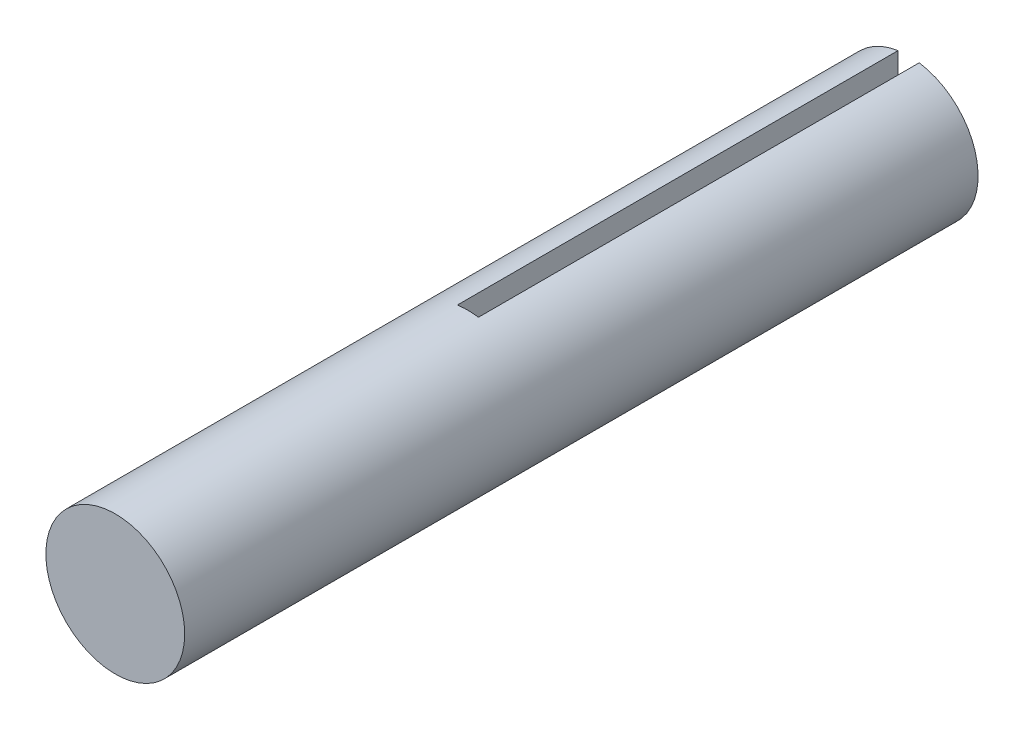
from build123d import *

# Parameters (mm, degrees)
SKETCH1_R          = 1.5
SKETCH1_R_2        = 0.99695
EXTRUDE1_DEPTH     = 9.525
SKETCH2_W          = 0.4572
SKETCH2_H          = 0.934356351
CUT_EXTRUDE1_DEPTH = 10.758361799
SKETCH4_R          = 1.5
EXTRUDE3_DEPTH     = 7.62


with BuildPart() as part:
    # Sketch1 → Extrude1 (new body)
    with BuildSketch(Plane.XY):
        with Locations(Location((0, 0, 0), (0, 0, 180))):
            Circle(SKETCH1_R)
        with Locations(Location((0, 0, 0), (0, 0, 180))):
            Circle(SKETCH1_R_2, mode=Mode.SUBTRACT)
    extrude(amount=EXTRUDE1_DEPTH)

    # Sketch2 → Cut-Extrude1 (cut, through all)
    with BuildSketch(Plane.XY):
        with Locations((0, 1.184995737)):
            Rectangle(SKETCH2_W, SKETCH2_H)
    extrude(amount=CUT_EXTRUDE1_DEPTH, mode=Mode.SUBTRACT)

    # Sketch4 → Extrude3 (add)
    with BuildSketch(Plane.XY.offset(9.525)):
        with Locations(Location((0, 0, 0), (0, 0, 98.766035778))):
            Circle(SKETCH4_R)
    extrude(amount=EXTRUDE3_DEPTH)


solid = part.part
